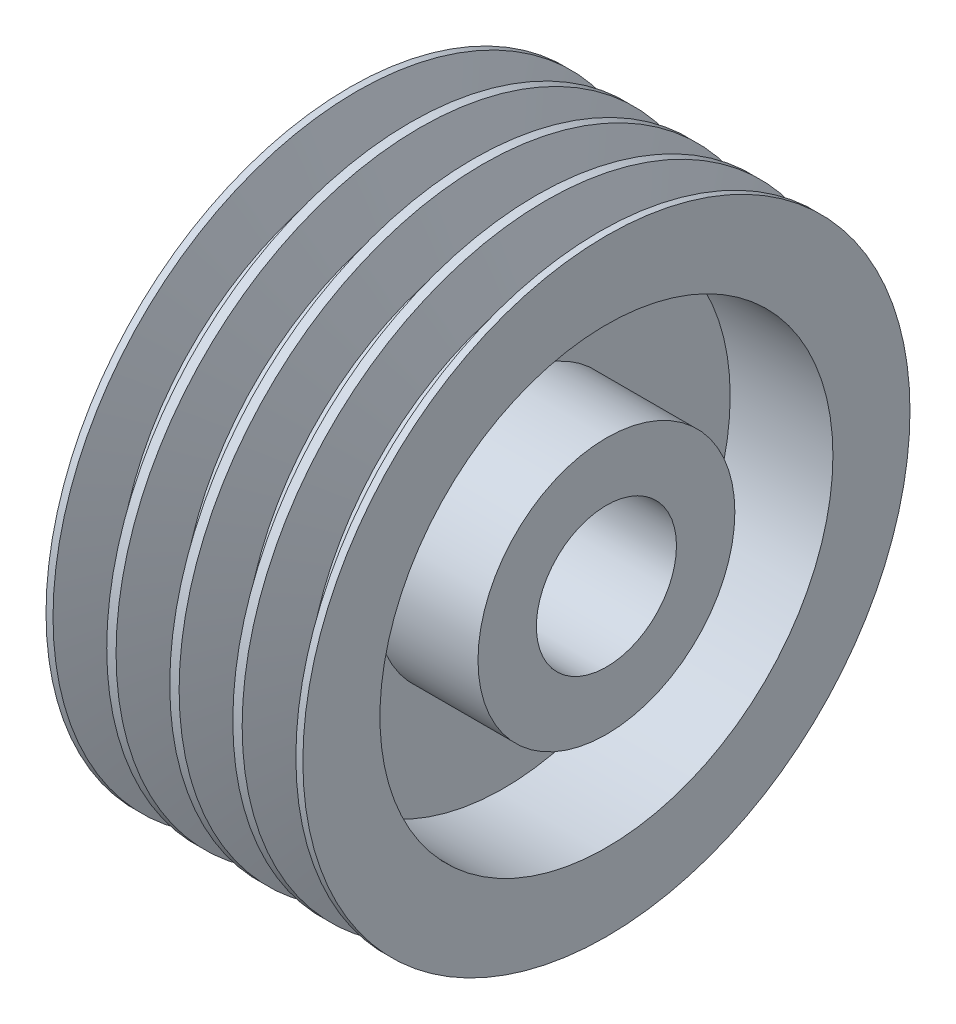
ISO-10303-21;
HEADER;
FILE_DESCRIPTION(('STEP AP214'),'2;1');
FILE_NAME('part.step','',(''),(''),'','','');
FILE_SCHEMA(('AUTOMOTIVE_DESIGN { 1 0 10303 214 1 1 1 1 }'));
ENDSEC;
DATA;
#1=APPLICATION_CONTEXT('core data for automotive mechanical design processes');
#2=APPLICATION_PROTOCOL_DEFINITION('international standard','automotive_design',2000,#1);
#3=PRODUCT_CONTEXT('',#1,'mechanical');
#4=PRODUCT('Part','Part','',(#3));
#5=PRODUCT_RELATED_PRODUCT_CATEGORY('part','',(#4));
#6=PRODUCT_DEFINITION_FORMATION('','',#4);
#7=PRODUCT_DEFINITION_CONTEXT('part definition',#1,'design');
#8=PRODUCT_DEFINITION('design','',#6,#7);
#9=PRODUCT_DEFINITION_SHAPE('','',#8);
#10=(LENGTH_UNIT() NAMED_UNIT(*) SI_UNIT(.MILLI.,.METRE.));
#11=(NAMED_UNIT(*) PLANE_ANGLE_UNIT() SI_UNIT($,.RADIAN.));
#12=(NAMED_UNIT(*) SI_UNIT($,.STERADIAN.) SOLID_ANGLE_UNIT());
#13=UNCERTAINTY_MEASURE_WITH_UNIT(LENGTH_MEASURE(1.E-05),#10,'distance_accuracy_value','');
#14=(GEOMETRIC_REPRESENTATION_CONTEXT(3) GLOBAL_UNCERTAINTY_ASSIGNED_CONTEXT((#13)) GLOBAL_UNIT_ASSIGNED_CONTEXT((#10,
#11,#12)) REPRESENTATION_CONTEXT('',''));
#15=CARTESIAN_POINT('',(0.,0.,0.));
#16=DIRECTION('',(0.,0.,1.));
#17=DIRECTION('',(1.,0.,0.));
#18=AXIS2_PLACEMENT_3D('',#15,#16,#17);
#19=CARTESIAN_POINT('',(-55.,30.,0.));
#20=DIRECTION('',(-1.,0.,0.));
#21=DIRECTION('',(0.,0.,1.));
#22=AXIS2_PLACEMENT_3D('',#19,#20,#21);
#23=PLANE('',#22);
#24=CARTESIAN_POINT('',(-55.,0.,0.));
#25=DIRECTION('',(1.,0.,0.));
#26=DIRECTION('',(0.,0.,-1.));
#27=AXIS2_PLACEMENT_3D('',#24,#25,#26);
#28=CIRCLE('',#27,30.);
#29=CARTESIAN_POINT('',(-55.,0.,-30.));
#30=VERTEX_POINT('',#29);
#31=EDGE_CURVE('E10',#30,#30,#28,.T.);
#32=ORIENTED_EDGE('',*,*,#31,.T.);
#33=EDGE_LOOP('',(#32));
#34=FACE_BOUND('',#33,.T.);
#35=CARTESIAN_POINT('',(-55.,0.,0.));
#36=DIRECTION('',(1.,0.,0.));
#37=DIRECTION('',(0.,0.,-1.));
#38=AXIS2_PLACEMENT_3D('',#35,#36,#37);
#39=CIRCLE('',#38,55.);
#40=CARTESIAN_POINT('',(-55.,0.,-55.));
#41=VERTEX_POINT('',#40);
#42=EDGE_CURVE('E119',#41,#41,#39,.T.);
#43=ORIENTED_EDGE('',*,*,#42,.F.);
#44=EDGE_LOOP('',(#43));
#45=FACE_BOUND('',#44,.T.);
#46=ADVANCED_FACE('F31',(#34,#45),#23,.T.);
#47=CARTESIAN_POINT('',(67.6211453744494,0.,0.));
#48=DIRECTION('',(1.,0.,0.));
#49=DIRECTION('',(0.,0.,-1.));
#50=AXIS2_PLACEMENT_3D('',#47,#48,#49);
#51=CYLINDRICAL_SURFACE('',#50,30.);
#52=CARTESIAN_POINT('',(55.,0.,0.));
#53=DIRECTION('',(1.,0.,0.));
#54=DIRECTION('',(0.,0.,-1.));
#55=AXIS2_PLACEMENT_3D('',#52,#53,#54);
#56=CIRCLE('',#55,30.);
#57=CARTESIAN_POINT('',(55.,0.,-30.));
#58=VERTEX_POINT('',#57);
#59=EDGE_CURVE('E37',#58,#58,#56,.T.);
#60=ORIENTED_EDGE('',*,*,#59,.T.);
#61=EDGE_LOOP('',(#60));
#62=FACE_BOUND('',#61,.T.);
#63=ORIENTED_EDGE('',*,*,#31,.F.);
#64=EDGE_LOOP('',(#63));
#65=FACE_BOUND('',#64,.T.);
#66=ADVANCED_FACE('F127',(#62,#65),#51,.F.);
#67=CARTESIAN_POINT('',(55.,30.,0.));
#68=DIRECTION('',(1.,0.,0.));
#69=DIRECTION('',(0.,0.,-1.));
#70=AXIS2_PLACEMENT_3D('',#67,#68,#69);
#71=PLANE('',#70);
#72=CARTESIAN_POINT('',(55.,0.,0.));
#73=DIRECTION('',(1.,0.,0.));
#74=DIRECTION('',(0.,0.,-1.));
#75=AXIS2_PLACEMENT_3D('',#72,#73,#74);
#76=CIRCLE('',#75,55.);
#77=CARTESIAN_POINT('',(55.,0.,-55.));
#78=VERTEX_POINT('',#77);
#79=EDGE_CURVE('E41',#78,#78,#76,.T.);
#80=ORIENTED_EDGE('',*,*,#79,.T.);
#81=EDGE_LOOP('',(#80));
#82=FACE_BOUND('',#81,.T.);
#83=ORIENTED_EDGE('',*,*,#59,.F.);
#84=EDGE_LOOP('',(#83));
#85=FACE_BOUND('',#84,.T.);
#86=ADVANCED_FACE('F131',(#82,#85),#71,.T.);
#87=CARTESIAN_POINT('',(67.6211453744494,0.,0.));
#88=DIRECTION('',(1.,0.,0.));
#89=DIRECTION('',(0.,0.,-1.));
#90=AXIS2_PLACEMENT_3D('',#87,#88,#89);
#91=CYLINDRICAL_SURFACE('',#90,55.);
#92=CARTESIAN_POINT('',(11.,0.,0.));
#93=DIRECTION('',(1.,0.,0.));
#94=DIRECTION('',(0.,0.,-1.));
#95=AXIS2_PLACEMENT_3D('',#92,#93,#94);
#96=CIRCLE('',#95,55.);
#97=CARTESIAN_POINT('',(11.,0.,-55.));
#98=VERTEX_POINT('',#97);
#99=EDGE_CURVE('E45',#98,#98,#96,.T.);
#100=ORIENTED_EDGE('',*,*,#99,.T.);
#101=EDGE_LOOP('',(#100));
#102=FACE_BOUND('',#101,.T.);
#103=ORIENTED_EDGE('',*,*,#79,.F.);
#104=EDGE_LOOP('',(#103));
#105=FACE_BOUND('',#104,.T.);
#106=ADVANCED_FACE('F135',(#102,#105),#91,.T.);
#107=CARTESIAN_POINT('',(11.,97.,0.));
#108=DIRECTION('',(1.,0.,0.));
#109=DIRECTION('',(0.,0.,-1.));
#110=AXIS2_PLACEMENT_3D('',#107,#108,#109);
#111=PLANE('',#110);
#112=CARTESIAN_POINT('',(11.,0.,0.));
#113=DIRECTION('',(1.,0.,0.));
#114=DIRECTION('',(0.,0.,-1.));
#115=AXIS2_PLACEMENT_3D('',#112,#113,#114);
#116=CIRCLE('',#115,97.);
#117=CARTESIAN_POINT('',(11.,0.,-97.));
#118=VERTEX_POINT('',#117);
#119=EDGE_CURVE('E50',#118,#118,#116,.T.);
#120=ORIENTED_EDGE('',*,*,#119,.T.);
#121=EDGE_LOOP('',(#120));
#122=FACE_BOUND('',#121,.T.);
#123=ORIENTED_EDGE('',*,*,#99,.F.);
#124=EDGE_LOOP('',(#123));
#125=FACE_BOUND('',#124,.T.);
#126=ADVANCED_FACE('F142',(#122,#125),#111,.T.);
#127=CARTESIAN_POINT('',(67.6211453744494,0.,0.));
#128=DIRECTION('',(1.,0.,0.));
#129=DIRECTION('',(0.,0.,-1.));
#130=AXIS2_PLACEMENT_3D('',#127,#128,#129);
#131=CYLINDRICAL_SURFACE('',#130,97.);
#132=CARTESIAN_POINT('',(55.,0.,0.));
#133=DIRECTION('',(1.,0.,0.));
#134=DIRECTION('',(0.,0.,-1.));
#135=AXIS2_PLACEMENT_3D('',#132,#133,#134);
#136=CIRCLE('',#135,97.);
#137=CARTESIAN_POINT('',(55.,0.,-97.));
#138=VERTEX_POINT('',#137);
#139=EDGE_CURVE('E53',#138,#138,#136,.T.);
#140=ORIENTED_EDGE('',*,*,#139,.T.);
#141=EDGE_LOOP('',(#140));
#142=FACE_BOUND('',#141,.T.);
#143=ORIENTED_EDGE('',*,*,#119,.F.);
#144=EDGE_LOOP('',(#143));
#145=FACE_BOUND('',#144,.T.);
#146=ADVANCED_FACE('F146',(#142,#145),#131,.F.);
#147=CARTESIAN_POINT('',(55.,97.,0.));
#148=DIRECTION('',(1.,0.,0.));
#149=DIRECTION('',(0.,0.,-1.));
#150=AXIS2_PLACEMENT_3D('',#147,#148,#149);
#151=PLANE('',#150);
#152=CARTESIAN_POINT('',(55.,0.,0.));
#153=DIRECTION('',(1.,0.,0.));
#154=DIRECTION('',(0.,0.,-1.));
#155=AXIS2_PLACEMENT_3D('',#152,#153,#154);
#156=CIRCLE('',#155,130.);
#157=CARTESIAN_POINT('',(55.,0.,-130.));
#158=VERTEX_POINT('',#157);
#159=EDGE_CURVE('E56',#158,#158,#156,.T.);
#160=ORIENTED_EDGE('',*,*,#159,.T.);
#161=EDGE_LOOP('',(#160));
#162=FACE_BOUND('',#161,.T.);
#163=ORIENTED_EDGE('',*,*,#139,.F.);
#164=EDGE_LOOP('',(#163));
#165=FACE_BOUND('',#164,.T.);
#166=ADVANCED_FACE('F150',(#162,#165),#151,.T.);
#167=CARTESIAN_POINT('',(67.6211453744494,0.,0.));
#168=DIRECTION('',(1.,0.,0.));
#169=DIRECTION('',(0.,0.,-1.));
#170=AXIS2_PLACEMENT_3D('',#167,#168,#169);
#171=CYLINDRICAL_SURFACE('',#170,130.);
#172=CARTESIAN_POINT('',(52.,0.,0.));
#173=DIRECTION('',(1.,0.,0.));
#174=DIRECTION('',(0.,0.,-1.));
#175=AXIS2_PLACEMENT_3D('',#172,#173,#174);
#176=CIRCLE('',#175,130.);
#177=CARTESIAN_POINT('',(52.,0.,-130.));
#178=VERTEX_POINT('',#177);
#179=EDGE_CURVE('E59',#178,#178,#176,.T.);
#180=ORIENTED_EDGE('',*,*,#179,.T.);
#181=EDGE_LOOP('',(#180));
#182=FACE_BOUND('',#181,.T.);
#183=ORIENTED_EDGE('',*,*,#159,.F.);
#184=EDGE_LOOP('',(#183));
#185=FACE_BOUND('',#184,.T.);
#186=ADVANCED_FACE('F154',(#182,#185),#171,.T.);
#187=CARTESIAN_POINT('',(52.,0.,0.));
#188=DIRECTION('',(1.,0.,0.));
#189=DIRECTION('',(0.,0.,-1.));
#190=AXIS2_PLACEMENT_3D('',#187,#188,#189);
#191=CONICAL_SURFACE('',#190,130.,1.27062515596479);
#192=CARTESIAN_POINT('',(45.5,0.,0.));
#193=DIRECTION('',(1.,0.,0.));
#194=DIRECTION('',(0.,0.,-1.));
#195=AXIS2_PLACEMENT_3D('',#192,#193,#194);
#196=CIRCLE('',#195,109.);
#197=CARTESIAN_POINT('',(45.5,0.,-109.));
#198=VERTEX_POINT('',#197);
#199=EDGE_CURVE('E62',#198,#198,#196,.T.);
#200=ORIENTED_EDGE('',*,*,#199,.T.);
#201=EDGE_LOOP('',(#200));
#202=FACE_BOUND('',#201,.T.);
#203=ORIENTED_EDGE('',*,*,#179,.F.);
#204=EDGE_LOOP('',(#203));
#205=FACE_BOUND('',#204,.T.);
#206=ADVANCED_FACE('F158',(#202,#205),#191,.T.);
#207=CARTESIAN_POINT('',(67.6211453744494,0.,0.));
#208=DIRECTION('',(1.,0.,0.));
#209=DIRECTION('',(0.,0.,-1.));
#210=AXIS2_PLACEMENT_3D('',#207,#208,#209);
#211=CYLINDRICAL_SURFACE('',#210,109.);
#212=CARTESIAN_POINT('',(35.5,0.,0.));
#213=DIRECTION('',(1.,0.,0.));
#214=DIRECTION('',(0.,0.,-1.));
#215=AXIS2_PLACEMENT_3D('',#212,#213,#214);
#216=CIRCLE('',#215,109.);
#217=CARTESIAN_POINT('',(35.5,0.,-109.));
#218=VERTEX_POINT('',#217);
#219=EDGE_CURVE('E65',#218,#218,#216,.T.);
#220=ORIENTED_EDGE('',*,*,#219,.T.);
#221=EDGE_LOOP('',(#220));
#222=FACE_BOUND('',#221,.T.);
#223=ORIENTED_EDGE('',*,*,#199,.F.);
#224=EDGE_LOOP('',(#223));
#225=FACE_BOUND('',#224,.T.);
#226=ADVANCED_FACE('F162',(#222,#225),#211,.T.);
#227=CARTESIAN_POINT('',(35.5,0.,0.));
#228=DIRECTION('',(-1.,0.,0.));
#229=DIRECTION('',(0.,0.,1.));
#230=AXIS2_PLACEMENT_3D('',#227,#228,#229);
#231=CONICAL_SURFACE('',#230,109.,1.27062515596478);
#232=CARTESIAN_POINT('',(29.,0.,0.));
#233=DIRECTION('',(1.,0.,0.));
#234=DIRECTION('',(0.,0.,-1.));
#235=AXIS2_PLACEMENT_3D('',#232,#233,#234);
#236=CIRCLE('',#235,130.);
#237=CARTESIAN_POINT('',(29.,0.,-130.));
#238=VERTEX_POINT('',#237);
#239=EDGE_CURVE('E68',#238,#238,#236,.T.);
#240=ORIENTED_EDGE('',*,*,#239,.T.);
#241=EDGE_LOOP('',(#240));
#242=FACE_BOUND('',#241,.T.);
#243=ORIENTED_EDGE('',*,*,#219,.F.);
#244=EDGE_LOOP('',(#243));
#245=FACE_BOUND('',#244,.T.);
#246=ADVANCED_FACE('F166',(#242,#245),#231,.T.);
#247=CARTESIAN_POINT('',(67.6211453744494,0.,0.));
#248=DIRECTION('',(1.,0.,0.));
#249=DIRECTION('',(0.,0.,-1.));
#250=AXIS2_PLACEMENT_3D('',#247,#248,#249);
#251=CYLINDRICAL_SURFACE('',#250,130.);
#252=CARTESIAN_POINT('',(25.,0.,0.));
#253=DIRECTION('',(1.,0.,0.));
#254=DIRECTION('',(0.,0.,-1.));
#255=AXIS2_PLACEMENT_3D('',#252,#253,#254);
#256=CIRCLE('',#255,130.);
#257=CARTESIAN_POINT('',(25.,0.,-130.));
#258=VERTEX_POINT('',#257);
#259=EDGE_CURVE('E71',#258,#258,#256,.T.);
#260=ORIENTED_EDGE('',*,*,#259,.T.);
#261=EDGE_LOOP('',(#260));
#262=FACE_BOUND('',#261,.T.);
#263=ORIENTED_EDGE('',*,*,#239,.F.);
#264=EDGE_LOOP('',(#263));
#265=FACE_BOUND('',#264,.T.);
#266=ADVANCED_FACE('F170',(#262,#265),#251,.T.);
#267=CARTESIAN_POINT('',(25.,0.,0.));
#268=DIRECTION('',(1.,0.,0.));
#269=DIRECTION('',(0.,0.,-1.));
#270=AXIS2_PLACEMENT_3D('',#267,#268,#269);
#271=CONICAL_SURFACE('',#270,130.,1.27062515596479);
#272=CARTESIAN_POINT('',(18.5,0.,0.));
#273=DIRECTION('',(1.,0.,0.));
#274=DIRECTION('',(0.,0.,-1.));
#275=AXIS2_PLACEMENT_3D('',#272,#273,#274);
#276=CIRCLE('',#275,109.);
#277=CARTESIAN_POINT('',(18.5,0.,-109.));
#278=VERTEX_POINT('',#277);
#279=EDGE_CURVE('E74',#278,#278,#276,.T.);
#280=ORIENTED_EDGE('',*,*,#279,.T.);
#281=EDGE_LOOP('',(#280));
#282=FACE_BOUND('',#281,.T.);
#283=ORIENTED_EDGE('',*,*,#259,.F.);
#284=EDGE_LOOP('',(#283));
#285=FACE_BOUND('',#284,.T.);
#286=ADVANCED_FACE('F174',(#282,#285),#271,.T.);
#287=CARTESIAN_POINT('',(67.6211453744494,0.,0.));
#288=DIRECTION('',(1.,0.,0.));
#289=DIRECTION('',(0.,0.,-1.));
#290=AXIS2_PLACEMENT_3D('',#287,#288,#289);
#291=CYLINDRICAL_SURFACE('',#290,109.);
#292=CARTESIAN_POINT('',(8.50000000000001,0.,0.));
#293=DIRECTION('',(1.,0.,0.));
#294=DIRECTION('',(0.,0.,-1.));
#295=AXIS2_PLACEMENT_3D('',#292,#293,#294);
#296=CIRCLE('',#295,109.);
#297=CARTESIAN_POINT('',(8.50000000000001,0.,-109.));
#298=VERTEX_POINT('',#297);
#299=EDGE_CURVE('E77',#298,#298,#296,.T.);
#300=ORIENTED_EDGE('',*,*,#299,.T.);
#301=EDGE_LOOP('',(#300));
#302=FACE_BOUND('',#301,.T.);
#303=ORIENTED_EDGE('',*,*,#279,.F.);
#304=EDGE_LOOP('',(#303));
#305=FACE_BOUND('',#304,.T.);
#306=ADVANCED_FACE('F178',(#302,#305),#291,.T.);
#307=CARTESIAN_POINT('',(8.50000000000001,0.,0.));
#308=DIRECTION('',(-1.,0.,0.));
#309=DIRECTION('',(0.,0.,1.));
#310=AXIS2_PLACEMENT_3D('',#307,#308,#309);
#311=CONICAL_SURFACE('',#310,109.,1.27062515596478);
#312=CARTESIAN_POINT('',(2.,0.,0.));
#313=DIRECTION('',(1.,0.,0.));
#314=DIRECTION('',(0.,0.,-1.));
#315=AXIS2_PLACEMENT_3D('',#312,#313,#314);
#316=CIRCLE('',#315,130.);
#317=CARTESIAN_POINT('',(2.,0.,-130.));
#318=VERTEX_POINT('',#317);
#319=EDGE_CURVE('E80',#318,#318,#316,.T.);
#320=ORIENTED_EDGE('',*,*,#319,.T.);
#321=EDGE_LOOP('',(#320));
#322=FACE_BOUND('',#321,.T.);
#323=ORIENTED_EDGE('',*,*,#299,.F.);
#324=EDGE_LOOP('',(#323));
#325=FACE_BOUND('',#324,.T.);
#326=ADVANCED_FACE('F182',(#322,#325),#311,.T.);
#327=CARTESIAN_POINT('',(67.6211453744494,0.,0.));
#328=DIRECTION('',(1.,0.,0.));
#329=DIRECTION('',(0.,0.,-1.));
#330=AXIS2_PLACEMENT_3D('',#327,#328,#329);
#331=CYLINDRICAL_SURFACE('',#330,130.);
#332=CARTESIAN_POINT('',(-2.,0.,0.));
#333=DIRECTION('',(1.,0.,0.));
#334=DIRECTION('',(0.,0.,-1.));
#335=AXIS2_PLACEMENT_3D('',#332,#333,#334);
#336=CIRCLE('',#335,130.);
#337=CARTESIAN_POINT('',(-2.,0.,-130.));
#338=VERTEX_POINT('',#337);
#339=EDGE_CURVE('E83',#338,#338,#336,.T.);
#340=ORIENTED_EDGE('',*,*,#339,.T.);
#341=EDGE_LOOP('',(#340));
#342=FACE_BOUND('',#341,.T.);
#343=ORIENTED_EDGE('',*,*,#319,.F.);
#344=EDGE_LOOP('',(#343));
#345=FACE_BOUND('',#344,.T.);
#346=ADVANCED_FACE('F186',(#342,#345),#331,.T.);
#347=CARTESIAN_POINT('',(-2.,0.,0.));
#348=DIRECTION('',(1.,0.,0.));
#349=DIRECTION('',(0.,0.,-1.));
#350=AXIS2_PLACEMENT_3D('',#347,#348,#349);
#351=CONICAL_SURFACE('',#350,130.,1.27062515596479);
#352=CARTESIAN_POINT('',(-8.49999999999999,0.,0.));
#353=DIRECTION('',(1.,0.,0.));
#354=DIRECTION('',(0.,0.,-1.));
#355=AXIS2_PLACEMENT_3D('',#352,#353,#354);
#356=CIRCLE('',#355,109.);
#357=CARTESIAN_POINT('',(-8.49999999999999,0.,-109.));
#358=VERTEX_POINT('',#357);
#359=EDGE_CURVE('E86',#358,#358,#356,.T.);
#360=ORIENTED_EDGE('',*,*,#359,.T.);
#361=EDGE_LOOP('',(#360));
#362=FACE_BOUND('',#361,.T.);
#363=ORIENTED_EDGE('',*,*,#339,.F.);
#364=EDGE_LOOP('',(#363));
#365=FACE_BOUND('',#364,.T.);
#366=ADVANCED_FACE('F190',(#362,#365),#351,.T.);
#367=CARTESIAN_POINT('',(67.6211453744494,0.,0.));
#368=DIRECTION('',(1.,0.,0.));
#369=DIRECTION('',(0.,0.,-1.));
#370=AXIS2_PLACEMENT_3D('',#367,#368,#369);
#371=CYLINDRICAL_SURFACE('',#370,109.);
#372=CARTESIAN_POINT('',(-18.5,0.,0.));
#373=DIRECTION('',(1.,0.,0.));
#374=DIRECTION('',(0.,0.,-1.));
#375=AXIS2_PLACEMENT_3D('',#372,#373,#374);
#376=CIRCLE('',#375,109.);
#377=CARTESIAN_POINT('',(-18.5,0.,-109.));
#378=VERTEX_POINT('',#377);
#379=EDGE_CURVE('E89',#378,#378,#376,.T.);
#380=ORIENTED_EDGE('',*,*,#379,.T.);
#381=EDGE_LOOP('',(#380));
#382=FACE_BOUND('',#381,.T.);
#383=ORIENTED_EDGE('',*,*,#359,.F.);
#384=EDGE_LOOP('',(#383));
#385=FACE_BOUND('',#384,.T.);
#386=ADVANCED_FACE('F194',(#382,#385),#371,.T.);
#387=CARTESIAN_POINT('',(-18.5,0.,0.));
#388=DIRECTION('',(-1.,0.,0.));
#389=DIRECTION('',(0.,0.,1.));
#390=AXIS2_PLACEMENT_3D('',#387,#388,#389);
#391=CONICAL_SURFACE('',#390,109.,1.27062515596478);
#392=CARTESIAN_POINT('',(-25.,0.,0.));
#393=DIRECTION('',(1.,0.,0.));
#394=DIRECTION('',(0.,0.,-1.));
#395=AXIS2_PLACEMENT_3D('',#392,#393,#394);
#396=CIRCLE('',#395,130.);
#397=CARTESIAN_POINT('',(-25.,0.,-130.));
#398=VERTEX_POINT('',#397);
#399=EDGE_CURVE('E92',#398,#398,#396,.T.);
#400=ORIENTED_EDGE('',*,*,#399,.T.);
#401=EDGE_LOOP('',(#400));
#402=FACE_BOUND('',#401,.T.);
#403=ORIENTED_EDGE('',*,*,#379,.F.);
#404=EDGE_LOOP('',(#403));
#405=FACE_BOUND('',#404,.T.);
#406=ADVANCED_FACE('F198',(#402,#405),#391,.T.);
#407=CARTESIAN_POINT('',(67.6211453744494,0.,0.));
#408=DIRECTION('',(1.,0.,0.));
#409=DIRECTION('',(0.,0.,-1.));
#410=AXIS2_PLACEMENT_3D('',#407,#408,#409);
#411=CYLINDRICAL_SURFACE('',#410,130.);
#412=CARTESIAN_POINT('',(-29.,0.,0.));
#413=DIRECTION('',(1.,0.,0.));
#414=DIRECTION('',(0.,0.,-1.));
#415=AXIS2_PLACEMENT_3D('',#412,#413,#414);
#416=CIRCLE('',#415,130.);
#417=CARTESIAN_POINT('',(-29.,0.,-130.));
#418=VERTEX_POINT('',#417);
#419=EDGE_CURVE('E95',#418,#418,#416,.T.);
#420=ORIENTED_EDGE('',*,*,#419,.T.);
#421=EDGE_LOOP('',(#420));
#422=FACE_BOUND('',#421,.T.);
#423=ORIENTED_EDGE('',*,*,#399,.F.);
#424=EDGE_LOOP('',(#423));
#425=FACE_BOUND('',#424,.T.);
#426=ADVANCED_FACE('F202',(#422,#425),#411,.T.);
#427=CARTESIAN_POINT('',(-29.,0.,0.));
#428=DIRECTION('',(1.,0.,0.));
#429=DIRECTION('',(0.,0.,-1.));
#430=AXIS2_PLACEMENT_3D('',#427,#428,#429);
#431=CONICAL_SURFACE('',#430,130.,1.27062515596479);
#432=CARTESIAN_POINT('',(-35.5,0.,0.));
#433=DIRECTION('',(1.,0.,0.));
#434=DIRECTION('',(0.,0.,-1.));
#435=AXIS2_PLACEMENT_3D('',#432,#433,#434);
#436=CIRCLE('',#435,109.);
#437=CARTESIAN_POINT('',(-35.5,0.,-109.));
#438=VERTEX_POINT('',#437);
#439=EDGE_CURVE('E98',#438,#438,#436,.T.);
#440=ORIENTED_EDGE('',*,*,#439,.T.);
#441=EDGE_LOOP('',(#440));
#442=FACE_BOUND('',#441,.T.);
#443=ORIENTED_EDGE('',*,*,#419,.F.);
#444=EDGE_LOOP('',(#443));
#445=FACE_BOUND('',#444,.T.);
#446=ADVANCED_FACE('F206',(#442,#445),#431,.T.);
#447=CARTESIAN_POINT('',(67.6211453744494,0.,0.));
#448=DIRECTION('',(1.,0.,0.));
#449=DIRECTION('',(0.,0.,-1.));
#450=AXIS2_PLACEMENT_3D('',#447,#448,#449);
#451=CYLINDRICAL_SURFACE('',#450,109.);
#452=CARTESIAN_POINT('',(-45.5,0.,0.));
#453=DIRECTION('',(1.,0.,0.));
#454=DIRECTION('',(0.,0.,-1.));
#455=AXIS2_PLACEMENT_3D('',#452,#453,#454);
#456=CIRCLE('',#455,109.);
#457=CARTESIAN_POINT('',(-45.5,0.,-109.));
#458=VERTEX_POINT('',#457);
#459=EDGE_CURVE('E101',#458,#458,#456,.T.);
#460=ORIENTED_EDGE('',*,*,#459,.T.);
#461=EDGE_LOOP('',(#460));
#462=FACE_BOUND('',#461,.T.);
#463=ORIENTED_EDGE('',*,*,#439,.F.);
#464=EDGE_LOOP('',(#463));
#465=FACE_BOUND('',#464,.T.);
#466=ADVANCED_FACE('F210',(#462,#465),#451,.T.);
#467=CARTESIAN_POINT('',(-45.5,0.,0.));
#468=DIRECTION('',(-1.,0.,0.));
#469=DIRECTION('',(0.,0.,1.));
#470=AXIS2_PLACEMENT_3D('',#467,#468,#469);
#471=CONICAL_SURFACE('',#470,109.,1.27062515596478);
#472=CARTESIAN_POINT('',(-52.,0.,0.));
#473=DIRECTION('',(1.,0.,0.));
#474=DIRECTION('',(0.,0.,-1.));
#475=AXIS2_PLACEMENT_3D('',#472,#473,#474);
#476=CIRCLE('',#475,130.);
#477=CARTESIAN_POINT('',(-52.,0.,-130.));
#478=VERTEX_POINT('',#477);
#479=EDGE_CURVE('E104',#478,#478,#476,.T.);
#480=ORIENTED_EDGE('',*,*,#479,.T.);
#481=EDGE_LOOP('',(#480));
#482=FACE_BOUND('',#481,.T.);
#483=ORIENTED_EDGE('',*,*,#459,.F.);
#484=EDGE_LOOP('',(#483));
#485=FACE_BOUND('',#484,.T.);
#486=ADVANCED_FACE('F214',(#482,#485),#471,.T.);
#487=CARTESIAN_POINT('',(67.6211453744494,0.,0.));
#488=DIRECTION('',(1.,0.,0.));
#489=DIRECTION('',(0.,0.,-1.));
#490=AXIS2_PLACEMENT_3D('',#487,#488,#489);
#491=CYLINDRICAL_SURFACE('',#490,130.);
#492=CARTESIAN_POINT('',(-55.,0.,0.));
#493=DIRECTION('',(1.,0.,0.));
#494=DIRECTION('',(0.,0.,-1.));
#495=AXIS2_PLACEMENT_3D('',#492,#493,#494);
#496=CIRCLE('',#495,130.);
#497=CARTESIAN_POINT('',(-55.,0.,-130.));
#498=VERTEX_POINT('',#497);
#499=EDGE_CURVE('E107',#498,#498,#496,.T.);
#500=ORIENTED_EDGE('',*,*,#499,.T.);
#501=EDGE_LOOP('',(#500));
#502=FACE_BOUND('',#501,.T.);
#503=ORIENTED_EDGE('',*,*,#479,.F.);
#504=EDGE_LOOP('',(#503));
#505=FACE_BOUND('',#504,.T.);
#506=ADVANCED_FACE('F218',(#502,#505),#491,.T.);
#507=CARTESIAN_POINT('',(-55.,97.,0.));
#508=DIRECTION('',(-1.,0.,0.));
#509=DIRECTION('',(0.,0.,1.));
#510=AXIS2_PLACEMENT_3D('',#507,#508,#509);
#511=PLANE('',#510);
#512=CARTESIAN_POINT('',(-55.,0.,0.));
#513=DIRECTION('',(1.,0.,0.));
#514=DIRECTION('',(0.,0.,-1.));
#515=AXIS2_PLACEMENT_3D('',#512,#513,#514);
#516=CIRCLE('',#515,97.);
#517=CARTESIAN_POINT('',(-55.,0.,-97.));
#518=VERTEX_POINT('',#517);
#519=EDGE_CURVE('E110',#518,#518,#516,.T.);
#520=ORIENTED_EDGE('',*,*,#519,.T.);
#521=EDGE_LOOP('',(#520));
#522=FACE_BOUND('',#521,.T.);
#523=ORIENTED_EDGE('',*,*,#499,.F.);
#524=EDGE_LOOP('',(#523));
#525=FACE_BOUND('',#524,.T.);
#526=ADVANCED_FACE('F222',(#522,#525),#511,.T.);
#527=CARTESIAN_POINT('',(67.6211453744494,0.,0.));
#528=DIRECTION('',(1.,0.,0.));
#529=DIRECTION('',(0.,0.,-1.));
#530=AXIS2_PLACEMENT_3D('',#527,#528,#529);
#531=CYLINDRICAL_SURFACE('',#530,97.);
#532=CARTESIAN_POINT('',(-11.,0.,0.));
#533=DIRECTION('',(1.,0.,0.));
#534=DIRECTION('',(0.,0.,-1.));
#535=AXIS2_PLACEMENT_3D('',#532,#533,#534);
#536=CIRCLE('',#535,97.);
#537=CARTESIAN_POINT('',(-11.,0.,-97.));
#538=VERTEX_POINT('',#537);
#539=EDGE_CURVE('E113',#538,#538,#536,.T.);
#540=ORIENTED_EDGE('',*,*,#539,.T.);
#541=EDGE_LOOP('',(#540));
#542=FACE_BOUND('',#541,.T.);
#543=ORIENTED_EDGE('',*,*,#519,.F.);
#544=EDGE_LOOP('',(#543));
#545=FACE_BOUND('',#544,.T.);
#546=ADVANCED_FACE('F226',(#542,#545),#531,.F.);
#547=CARTESIAN_POINT('',(-11.,97.,0.));
#548=DIRECTION('',(-1.,0.,0.));
#549=DIRECTION('',(0.,0.,1.));
#550=AXIS2_PLACEMENT_3D('',#547,#548,#549);
#551=PLANE('',#550);
#552=CARTESIAN_POINT('',(-11.,0.,0.));
#553=DIRECTION('',(1.,0.,0.));
#554=DIRECTION('',(0.,0.,-1.));
#555=AXIS2_PLACEMENT_3D('',#552,#553,#554);
#556=CIRCLE('',#555,55.);
#557=CARTESIAN_POINT('',(-11.,0.,-55.));
#558=VERTEX_POINT('',#557);
#559=EDGE_CURVE('E116',#558,#558,#556,.T.);
#560=ORIENTED_EDGE('',*,*,#559,.T.);
#561=EDGE_LOOP('',(#560));
#562=FACE_BOUND('',#561,.T.);
#563=ORIENTED_EDGE('',*,*,#539,.F.);
#564=EDGE_LOOP('',(#563));
#565=FACE_BOUND('',#564,.T.);
#566=ADVANCED_FACE('F230',(#562,#565),#551,.T.);
#567=CARTESIAN_POINT('',(67.6211453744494,0.,0.));
#568=DIRECTION('',(1.,0.,0.));
#569=DIRECTION('',(0.,0.,-1.));
#570=AXIS2_PLACEMENT_3D('',#567,#568,#569);
#571=CYLINDRICAL_SURFACE('',#570,55.);
#572=ORIENTED_EDGE('',*,*,#42,.T.);
#573=EDGE_LOOP('',(#572));
#574=FACE_BOUND('',#573,.T.);
#575=ORIENTED_EDGE('',*,*,#559,.F.);
#576=EDGE_LOOP('',(#575));
#577=FACE_BOUND('',#576,.T.);
#578=ADVANCED_FACE('F123',(#574,#577),#571,.T.);
#579=CLOSED_SHELL('',(#46,#66,#86,#106,#126,#146,#166,#186,#206,#226,#246,#266,#286,#306,#326,
#346,#366,#386,#406,#426,#446,#466,#486,#506,#526,#546,#566,#578));
#580=MANIFOLD_SOLID_BREP('B2',#579);
#581=ADVANCED_BREP_SHAPE_REPRESENTATION('',(#18,#580),#14);
#582=SHAPE_DEFINITION_REPRESENTATION(#9,#581);
ENDSEC;
END-ISO-10303-21;
